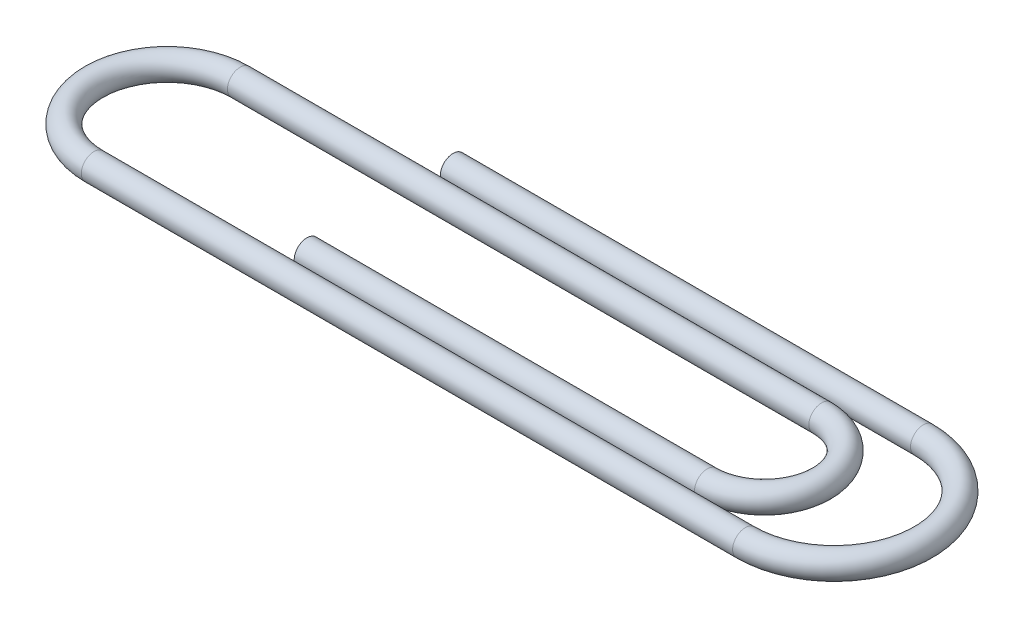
ISO-10303-21;
HEADER;
FILE_DESCRIPTION(('STEP AP214'),'2;1');
FILE_NAME('part.step','',(''),(''),'','','');
FILE_SCHEMA(('AUTOMOTIVE_DESIGN { 1 0 10303 214 1 1 1 1 }'));
ENDSEC;
DATA;
#1=APPLICATION_CONTEXT('core data for automotive mechanical design processes');
#2=APPLICATION_PROTOCOL_DEFINITION('international standard','automotive_design',2000,#1);
#3=PRODUCT_CONTEXT('',#1,'mechanical');
#4=PRODUCT('Part','Part','',(#3));
#5=PRODUCT_RELATED_PRODUCT_CATEGORY('part','',(#4));
#6=PRODUCT_DEFINITION_FORMATION('','',#4);
#7=PRODUCT_DEFINITION_CONTEXT('part definition',#1,'design');
#8=PRODUCT_DEFINITION('design','',#6,#7);
#9=PRODUCT_DEFINITION_SHAPE('','',#8);
#10=(LENGTH_UNIT() NAMED_UNIT(*) SI_UNIT(.MILLI.,.METRE.));
#11=(NAMED_UNIT(*) PLANE_ANGLE_UNIT() SI_UNIT($,.RADIAN.));
#12=(NAMED_UNIT(*) SI_UNIT($,.STERADIAN.) SOLID_ANGLE_UNIT());
#13=UNCERTAINTY_MEASURE_WITH_UNIT(LENGTH_MEASURE(1.E-05),#10,'distance_accuracy_value','');
#14=(GEOMETRIC_REPRESENTATION_CONTEXT(3) GLOBAL_UNCERTAINTY_ASSIGNED_CONTEXT((#13)) GLOBAL_UNIT_ASSIGNED_CONTEXT((#10,
#11,#12)) REPRESENTATION_CONTEXT('',''));
#15=CARTESIAN_POINT('',(0.,0.,0.));
#16=DIRECTION('',(0.,0.,1.));
#17=DIRECTION('',(1.,0.,0.));
#18=AXIS2_PLACEMENT_3D('',#15,#16,#17);
#19=CARTESIAN_POINT('',(18.5,0.,-5.75));
#20=DIRECTION('',(-1.,0.,0.));
#21=DIRECTION('',(0.,0.,1.));
#22=AXIS2_PLACEMENT_3D('',#19,#20,#21);
#23=CYLINDRICAL_SURFACE('',#22,0.5);
#24=CARTESIAN_POINT('',(18.5,0.,-5.75));
#25=DIRECTION('',(-1.,0.,0.));
#26=DIRECTION('',(0.,0.,1.));
#27=AXIS2_PLACEMENT_3D('',#24,#25,#26);
#28=CIRCLE('',#27,0.5);
#29=CARTESIAN_POINT('',(18.5,0.,-6.25));
#30=VERTEX_POINT('',#29);
#31=EDGE_CURVE('E36',#30,#30,#28,.T.);
#32=ORIENTED_EDGE('',*,*,#31,.T.);
#33=EDGE_LOOP('',(#32));
#34=FACE_BOUND('',#33,.T.);
#35=CARTESIAN_POINT('',(0.,0.,-5.75));
#36=DIRECTION('',(-1.,0.,0.));
#37=DIRECTION('',(0.,0.,1.));
#38=AXIS2_PLACEMENT_3D('',#35,#36,#37);
#39=CIRCLE('',#38,0.5);
#40=CARTESIAN_POINT('',(0.,0.,-5.25));
#41=VERTEX_POINT('',#40);
#42=EDGE_CURVE('E10',#41,#41,#39,.T.);
#43=ORIENTED_EDGE('',*,*,#42,.F.);
#44=EDGE_LOOP('',(#43));
#45=FACE_BOUND('',#44,.T.);
#46=ADVANCED_FACE('F30',(#34,#45),#23,.T.);
#47=CARTESIAN_POINT('',(18.5,0.,-2.25));
#48=DIRECTION('',(0.,1.,0.));
#49=DIRECTION('',(0.,0.,1.));
#50=AXIS2_PLACEMENT_3D('',#47,#48,#49);
#51=TOROIDAL_SURFACE('',#50,3.5,0.5);
#52=CARTESIAN_POINT('',(18.5,0.,1.25));
#53=DIRECTION('',(1.,0.,0.));
#54=DIRECTION('',(0.,0.,-1.));
#55=AXIS2_PLACEMENT_3D('',#52,#53,#54);
#56=CIRCLE('',#55,0.5);
#57=CARTESIAN_POINT('',(18.5,0.,1.75));
#58=VERTEX_POINT('',#57);
#59=EDGE_CURVE('E40',#58,#58,#56,.T.);
#60=CARTESIAN_POINT('',(18.5,0.,-2.25));
#61=DIRECTION('',(0.,1.,0.));
#62=DIRECTION('',(0.,0.,1.));
#63=AXIS2_PLACEMENT_3D('',#60,#61,#62);
#64=CIRCLE('',#63,4.);
#65=EDGE_CURVE('',#58,#30,#64,.T.);
#66=ORIENTED_EDGE('',*,*,#59,.T.);
#67=ORIENTED_EDGE('',*,*,#31,.F.);
#68=ORIENTED_EDGE('',*,*,#65,.T.);
#69=ORIENTED_EDGE('',*,*,#65,.F.);
#70=EDGE_LOOP('',(#66,#68,#67,#69));
#71=FACE_BOUND('',#70,.T.);
#72=ADVANCED_FACE('F80',(#71),#51,.T.);
#73=CARTESIAN_POINT('',(-7.125,0.,1.25));
#74=DIRECTION('',(1.,0.,0.));
#75=DIRECTION('',(0.,0.,-1.));
#76=AXIS2_PLACEMENT_3D('',#73,#74,#75);
#77=CYLINDRICAL_SURFACE('',#76,0.5);
#78=CARTESIAN_POINT('',(-7.125,0.,1.25));
#79=DIRECTION('',(1.,0.,0.));
#80=DIRECTION('',(0.,0.,-1.));
#81=AXIS2_PLACEMENT_3D('',#78,#79,#80);
#82=CIRCLE('',#81,0.5);
#83=CARTESIAN_POINT('',(-7.125,0.,1.75));
#84=VERTEX_POINT('',#83);
#85=EDGE_CURVE('E44',#84,#84,#82,.T.);
#86=ORIENTED_EDGE('',*,*,#85,.T.);
#87=EDGE_LOOP('',(#86));
#88=FACE_BOUND('',#87,.T.);
#89=ORIENTED_EDGE('',*,*,#59,.F.);
#90=EDGE_LOOP('',(#89));
#91=FACE_BOUND('',#90,.T.);
#92=ADVANCED_FACE('F84',(#88,#91),#77,.T.);
#93=CARTESIAN_POINT('',(-7.125,0.,-1.625));
#94=DIRECTION('',(0.,1.,0.));
#95=DIRECTION('',(0.,0.,1.));
#96=AXIS2_PLACEMENT_3D('',#93,#94,#95);
#97=TOROIDAL_SURFACE('',#96,2.875,0.5);
#98=CARTESIAN_POINT('',(-7.125,0.,-4.5));
#99=DIRECTION('',(-1.,0.,0.));
#100=DIRECTION('',(0.,0.,1.));
#101=AXIS2_PLACEMENT_3D('',#98,#99,#100);
#102=CIRCLE('',#101,0.5);
#103=CARTESIAN_POINT('',(-7.125,0.,-5.));
#104=VERTEX_POINT('',#103);
#105=EDGE_CURVE('E49',#104,#104,#102,.T.);
#106=CARTESIAN_POINT('',(-7.125,0.,-1.625));
#107=DIRECTION('',(0.,1.,0.));
#108=DIRECTION('',(0.,0.,1.));
#109=AXIS2_PLACEMENT_3D('',#106,#107,#108);
#110=CIRCLE('',#109,3.375);
#111=EDGE_CURVE('',#104,#84,#110,.T.);
#112=ORIENTED_EDGE('',*,*,#105,.T.);
#113=ORIENTED_EDGE('',*,*,#85,.F.);
#114=ORIENTED_EDGE('',*,*,#111,.T.);
#115=ORIENTED_EDGE('',*,*,#111,.F.);
#116=EDGE_LOOP('',(#112,#114,#113,#115));
#117=FACE_BOUND('',#116,.T.);
#118=ADVANCED_FACE('F90',(#117),#97,.T.);
#119=CARTESIAN_POINT('',(15.75,0.,-4.5));
#120=DIRECTION('',(-1.,0.,0.));
#121=DIRECTION('',(0.,0.,1.));
#122=AXIS2_PLACEMENT_3D('',#119,#120,#121);
#123=CYLINDRICAL_SURFACE('',#122,0.5);
#124=CARTESIAN_POINT('',(15.75,0.,-4.5));
#125=DIRECTION('',(-1.,0.,0.));
#126=DIRECTION('',(0.,0.,1.));
#127=AXIS2_PLACEMENT_3D('',#124,#125,#126);
#128=CIRCLE('',#127,0.5);
#129=CARTESIAN_POINT('',(15.75,0.,-5.));
#130=VERTEX_POINT('',#129);
#131=EDGE_CURVE('E52',#130,#130,#128,.T.);
#132=ORIENTED_EDGE('',*,*,#131,.T.);
#133=EDGE_LOOP('',(#132));
#134=FACE_BOUND('',#133,.T.);
#135=ORIENTED_EDGE('',*,*,#105,.F.);
#136=EDGE_LOOP('',(#135));
#137=FACE_BOUND('',#136,.T.);
#138=ADVANCED_FACE('F97',(#134,#137),#123,.T.);
#139=CARTESIAN_POINT('',(15.75,0.,-2.25));
#140=DIRECTION('',(0.,1.,0.));
#141=DIRECTION('',(0.,0.,1.));
#142=AXIS2_PLACEMENT_3D('',#139,#140,#141);
#143=TOROIDAL_SURFACE('',#142,2.25,0.5);
#144=CARTESIAN_POINT('',(15.75,0.,0.));
#145=DIRECTION('',(1.,0.,0.));
#146=DIRECTION('',(0.,0.,-1.));
#147=AXIS2_PLACEMENT_3D('',#144,#145,#146);
#148=CIRCLE('',#147,0.5);
#149=CARTESIAN_POINT('',(15.75,0.,0.5));
#150=VERTEX_POINT('',#149);
#151=EDGE_CURVE('E55',#150,#150,#148,.T.);
#152=CARTESIAN_POINT('',(15.75,0.,-2.25));
#153=DIRECTION('',(0.,1.,0.));
#154=DIRECTION('',(0.,0.,1.));
#155=AXIS2_PLACEMENT_3D('',#152,#153,#154);
#156=CIRCLE('',#155,2.75);
#157=EDGE_CURVE('',#150,#130,#156,.T.);
#158=ORIENTED_EDGE('',*,*,#151,.T.);
#159=ORIENTED_EDGE('',*,*,#131,.F.);
#160=ORIENTED_EDGE('',*,*,#157,.T.);
#161=ORIENTED_EDGE('',*,*,#157,.F.);
#162=EDGE_LOOP('',(#158,#160,#159,#161));
#163=FACE_BOUND('',#162,.T.);
#164=ADVANCED_FACE('F62',(#163),#143,.T.);
#165=CARTESIAN_POINT('',(15.75,0.,0.));
#166=DIRECTION('',(-1.,0.,0.));
#167=DIRECTION('',(0.,0.,1.));
#168=AXIS2_PLACEMENT_3D('',#165,#166,#167);
#169=CYLINDRICAL_SURFACE('',#168,0.5);
#170=ORIENTED_EDGE('',*,*,#151,.F.);
#171=EDGE_LOOP('',(#170));
#172=FACE_BOUND('',#171,.T.);
#173=CARTESIAN_POINT('',(0.,0.,0.));
#174=DIRECTION('',(1.,0.,0.));
#175=DIRECTION('',(0.,0.,-1.));
#176=AXIS2_PLACEMENT_3D('',#173,#174,#175);
#177=CIRCLE('',#176,0.5);
#178=CARTESIAN_POINT('',(0.,0.,-0.5));
#179=VERTEX_POINT('',#178);
#180=EDGE_CURVE('E56',#179,#179,#177,.T.);
#181=ORIENTED_EDGE('',*,*,#180,.T.);
#182=EDGE_LOOP('',(#181));
#183=FACE_BOUND('',#182,.T.);
#184=ADVANCED_FACE('F65',(#172,#183),#169,.T.);
#185=CARTESIAN_POINT('',(0.,0.,-5.75));
#186=DIRECTION('',(-1.,0.,0.));
#187=DIRECTION('',(0.,0.,1.));
#188=AXIS2_PLACEMENT_3D('',#185,#186,#187);
#189=PLANE('',#188);
#190=ORIENTED_EDGE('',*,*,#42,.T.);
#191=EDGE_LOOP('',(#190));
#192=FACE_BOUND('',#191,.T.);
#193=ADVANCED_FACE('F68',(#192),#189,.T.);
#194=CARTESIAN_POINT('',(0.,0.,0.));
#195=DIRECTION('',(1.,0.,0.));
#196=DIRECTION('',(0.,0.,-1.));
#197=AXIS2_PLACEMENT_3D('',#194,#195,#196);
#198=PLANE('',#197);
#199=ORIENTED_EDGE('',*,*,#180,.F.);
#200=EDGE_LOOP('',(#199));
#201=FACE_BOUND('',#200,.T.);
#202=ADVANCED_FACE('F72',(#201),#198,.F.);
#203=CLOSED_SHELL('',(#46,#72,#92,#118,#138,#164,#184,#193,#202));
#204=MANIFOLD_SOLID_BREP('B2',#203);
#205=ADVANCED_BREP_SHAPE_REPRESENTATION('',(#18,#204),#14);
#206=SHAPE_DEFINITION_REPRESENTATION(#9,#205);
ENDSEC;
END-ISO-10303-21;
